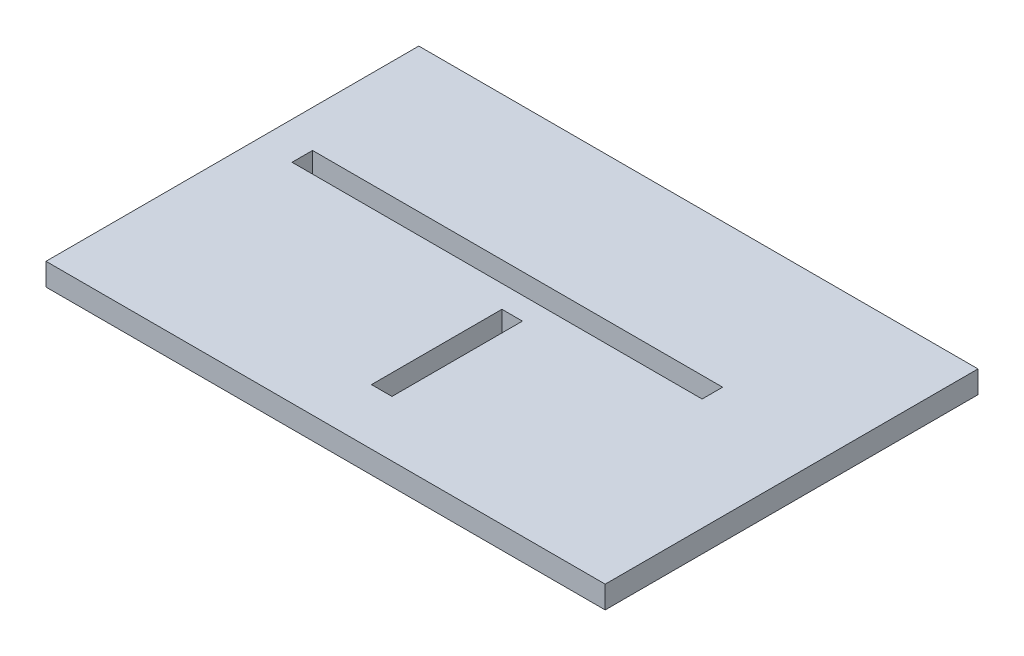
ISO-10303-21;
HEADER;
FILE_DESCRIPTION(('STEP AP214'),'2;1');
FILE_NAME('part.step','',(''),(''),'','','');
FILE_SCHEMA(('AUTOMOTIVE_DESIGN { 1 0 10303 214 1 1 1 1 }'));
ENDSEC;
DATA;
#1=APPLICATION_CONTEXT('core data for automotive mechanical design processes');
#2=APPLICATION_PROTOCOL_DEFINITION('international standard','automotive_design',2000,#1);
#3=PRODUCT_CONTEXT('',#1,'mechanical');
#4=PRODUCT('Part','Part','',(#3));
#5=PRODUCT_RELATED_PRODUCT_CATEGORY('part','',(#4));
#6=PRODUCT_DEFINITION_FORMATION('','',#4);
#7=PRODUCT_DEFINITION_CONTEXT('part definition',#1,'design');
#8=PRODUCT_DEFINITION('design','',#6,#7);
#9=PRODUCT_DEFINITION_SHAPE('','',#8);
#10=(LENGTH_UNIT() NAMED_UNIT(*) SI_UNIT(.MILLI.,.METRE.));
#11=(NAMED_UNIT(*) PLANE_ANGLE_UNIT() SI_UNIT($,.RADIAN.));
#12=(NAMED_UNIT(*) SI_UNIT($,.STERADIAN.) SOLID_ANGLE_UNIT());
#13=UNCERTAINTY_MEASURE_WITH_UNIT(LENGTH_MEASURE(1.E-05),#10,'distance_accuracy_value','');
#14=(GEOMETRIC_REPRESENTATION_CONTEXT(3) GLOBAL_UNCERTAINTY_ASSIGNED_CONTEXT((#13)) GLOBAL_UNIT_ASSIGNED_CONTEXT((#10,
#11,#12)) REPRESENTATION_CONTEXT('',''));
#15=CARTESIAN_POINT('',(0.,0.,0.));
#16=DIRECTION('',(0.,0.,1.));
#17=DIRECTION('',(1.,0.,0.));
#18=AXIS2_PLACEMENT_3D('',#15,#16,#17);
#19=CARTESIAN_POINT('',(0.,6.,0.));
#20=DIRECTION('',(0.,1.,0.));
#21=DIRECTION('',(0.,0.,1.));
#22=AXIS2_PLACEMENT_3D('',#19,#20,#21);
#23=PLANE('',#22);
#24=DIRECTION('',(0.,0.,-1.));
#25=VECTOR('',#24,1.);
#26=CARTESIAN_POINT('',(75.,6.,-50.));
#27=LINE('',#26,#25);
#28=CARTESIAN_POINT('',(75.,6.,50.));
#29=VERTEX_POINT('',#28);
#30=CARTESIAN_POINT('',(75.,6.,-50.));
#31=VERTEX_POINT('',#30);
#32=EDGE_CURVE('E193',#29,#31,#27,.T.);
#33=ORIENTED_EDGE('',*,*,#32,.T.);
#34=DIRECTION('',(-1.,0.,0.));
#35=VECTOR('',#34,1.);
#36=CARTESIAN_POINT('',(-75.,6.,-50.));
#37=LINE('',#36,#35);
#38=CARTESIAN_POINT('',(-75.,6.,-50.));
#39=VERTEX_POINT('',#38);
#40=EDGE_CURVE('E196',#31,#39,#37,.T.);
#41=ORIENTED_EDGE('',*,*,#40,.T.);
#42=DIRECTION('',(0.,0.,1.));
#43=VECTOR('',#42,1.);
#44=CARTESIAN_POINT('',(-75.,6.,-50.));
#45=LINE('',#44,#43);
#46=CARTESIAN_POINT('',(-75.,6.,50.));
#47=VERTEX_POINT('',#46);
#48=EDGE_CURVE('E199',#39,#47,#45,.T.);
#49=ORIENTED_EDGE('',*,*,#48,.T.);
#50=DIRECTION('',(1.,0.,0.));
#51=VECTOR('',#50,1.);
#52=CARTESIAN_POINT('',(-75.,6.,50.));
#53=LINE('',#52,#51);
#54=EDGE_CURVE('E201',#47,#29,#53,.T.);
#55=ORIENTED_EDGE('',*,*,#54,.T.);
#56=EDGE_LOOP('',(#33,#41,#49,#55));
#57=FACE_BOUND('',#56,.T.);
#58=DIRECTION('',(-1.,0.,0.));
#59=VECTOR('',#58,1.);
#60=CARTESIAN_POINT('',(-2.7,6.,0.));
#61=LINE('',#60,#59);
#62=CARTESIAN_POINT('',(2.79999999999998,6.,0.));
#63=VERTEX_POINT('',#62);
#64=CARTESIAN_POINT('',(-2.7,6.,0.));
#65=VERTEX_POINT('',#64);
#66=EDGE_CURVE('E164',#63,#65,#61,.T.);
#67=ORIENTED_EDGE('',*,*,#66,.F.);
#68=DIRECTION('',(0.,0.,-1.));
#69=VECTOR('',#68,1.);
#70=CARTESIAN_POINT('',(2.79999999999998,6.,0.));
#71=LINE('',#70,#69);
#72=CARTESIAN_POINT('',(2.8,6.,35.));
#73=VERTEX_POINT('',#72);
#74=EDGE_CURVE('E162',#73,#63,#71,.T.);
#75=ORIENTED_EDGE('',*,*,#74,.F.);
#76=DIRECTION('',(1.,0.,0.));
#77=VECTOR('',#76,1.);
#78=CARTESIAN_POINT('',(-2.7,6.,35.));
#79=LINE('',#78,#77);
#80=CARTESIAN_POINT('',(-2.7,6.,35.));
#81=VERTEX_POINT('',#80);
#82=EDGE_CURVE('E170',#81,#73,#79,.T.);
#83=ORIENTED_EDGE('',*,*,#82,.F.);
#84=DIRECTION('',(0.,0.,1.));
#85=VECTOR('',#84,1.);
#86=CARTESIAN_POINT('',(-2.7,6.,0.));
#87=LINE('',#86,#85);
#88=EDGE_CURVE('E167',#65,#81,#87,.T.);
#89=ORIENTED_EDGE('',*,*,#88,.F.);
#90=EDGE_LOOP('',(#67,#75,#83,#89));
#91=FACE_BOUND('',#90,.T.);
#92=DIRECTION('',(-1.,0.,0.));
#93=VECTOR('',#92,1.);
#94=CARTESIAN_POINT('',(-65.,6.,-11.5));
#95=LINE('',#94,#93);
#96=CARTESIAN_POINT('',(45.,6.,-11.5));
#97=VERTEX_POINT('',#96);
#98=CARTESIAN_POINT('',(-65.,6.,-11.5));
#99=VERTEX_POINT('',#98);
#100=EDGE_CURVE('E134',#97,#99,#95,.T.);
#101=ORIENTED_EDGE('',*,*,#100,.F.);
#102=DIRECTION('',(0.,0.,-1.));
#103=VECTOR('',#102,1.);
#104=CARTESIAN_POINT('',(45.,6.,-11.5));
#105=LINE('',#104,#103);
#106=CARTESIAN_POINT('',(45.,6.,-6.));
#107=VERTEX_POINT('',#106);
#108=EDGE_CURVE('E126',#107,#97,#105,.T.);
#109=ORIENTED_EDGE('',*,*,#108,.F.);
#110=DIRECTION('',(1.,0.,0.));
#111=VECTOR('',#110,1.);
#112=CARTESIAN_POINT('',(-65.,6.,-5.99999999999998));
#113=LINE('',#112,#111);
#114=CARTESIAN_POINT('',(-65.,6.,-5.99999999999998));
#115=VERTEX_POINT('',#114);
#116=EDGE_CURVE('E148',#115,#107,#113,.T.);
#117=ORIENTED_EDGE('',*,*,#116,.F.);
#118=DIRECTION('',(0.,0.,1.));
#119=VECTOR('',#118,1.);
#120=CARTESIAN_POINT('',(-65.,6.,-11.5));
#121=LINE('',#120,#119);
#122=EDGE_CURVE('E146',#99,#115,#121,.T.);
#123=ORIENTED_EDGE('',*,*,#122,.F.);
#124=EDGE_LOOP('',(#101,#109,#117,#123));
#125=FACE_BOUND('',#124,.T.);
#126=ADVANCED_FACE('F37',(#57,#91,#125),#23,.T.);
#127=CARTESIAN_POINT('',(0.,0.,0.));
#128=DIRECTION('',(0.,1.,0.));
#129=DIRECTION('',(0.,0.,1.));
#130=AXIS2_PLACEMENT_3D('',#127,#128,#129);
#131=PLANE('',#130);
#132=DIRECTION('',(0.,0.,-1.));
#133=VECTOR('',#132,1.);
#134=CARTESIAN_POINT('',(2.79999999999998,0.,0.));
#135=LINE('',#134,#133);
#136=CARTESIAN_POINT('',(2.8,0.,35.));
#137=VERTEX_POINT('',#136);
#138=CARTESIAN_POINT('',(2.79999999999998,0.,0.));
#139=VERTEX_POINT('',#138);
#140=EDGE_CURVE('E142',#137,#139,#135,.T.);
#141=ORIENTED_EDGE('',*,*,#140,.T.);
#142=DIRECTION('',(-1.,0.,0.));
#143=VECTOR('',#142,1.);
#144=CARTESIAN_POINT('',(-2.7,0.,0.));
#145=LINE('',#144,#143);
#146=CARTESIAN_POINT('',(-2.7,0.,0.));
#147=VERTEX_POINT('',#146);
#148=EDGE_CURVE('E175',#139,#147,#145,.T.);
#149=ORIENTED_EDGE('',*,*,#148,.T.);
#150=DIRECTION('',(0.,0.,1.));
#151=VECTOR('',#150,1.);
#152=CARTESIAN_POINT('',(-2.7,0.,0.));
#153=LINE('',#152,#151);
#154=CARTESIAN_POINT('',(-2.7,0.,35.));
#155=VERTEX_POINT('',#154);
#156=EDGE_CURVE('E178',#147,#155,#153,.T.);
#157=ORIENTED_EDGE('',*,*,#156,.T.);
#158=DIRECTION('',(1.,0.,0.));
#159=VECTOR('',#158,1.);
#160=CARTESIAN_POINT('',(-2.7,0.,35.));
#161=LINE('',#160,#159);
#162=EDGE_CURVE('E165',#155,#137,#161,.T.);
#163=ORIENTED_EDGE('',*,*,#162,.T.);
#164=EDGE_LOOP('',(#141,#149,#157,#163));
#165=FACE_BOUND('',#164,.T.);
#166=DIRECTION('',(0.,0.,-1.));
#167=VECTOR('',#166,1.);
#168=CARTESIAN_POINT('',(75.,0.,-50.));
#169=LINE('',#168,#167);
#170=CARTESIAN_POINT('',(75.,0.,50.));
#171=VERTEX_POINT('',#170);
#172=CARTESIAN_POINT('',(75.,0.,-50.));
#173=VERTEX_POINT('',#172);
#174=EDGE_CURVE('E192',#171,#173,#169,.T.);
#175=ORIENTED_EDGE('',*,*,#174,.F.);
#176=DIRECTION('',(1.,0.,0.));
#177=VECTOR('',#176,1.);
#178=CARTESIAN_POINT('',(-75.,0.,50.));
#179=LINE('',#178,#177);
#180=CARTESIAN_POINT('',(-75.,0.,50.));
#181=VERTEX_POINT('',#180);
#182=EDGE_CURVE('E197',#181,#171,#179,.T.);
#183=ORIENTED_EDGE('',*,*,#182,.F.);
#184=DIRECTION('',(0.,0.,1.));
#185=VECTOR('',#184,1.);
#186=CARTESIAN_POINT('',(-75.,0.,-50.));
#187=LINE('',#186,#185);
#188=CARTESIAN_POINT('',(-75.,0.,-50.));
#189=VERTEX_POINT('',#188);
#190=EDGE_CURVE('E208',#189,#181,#187,.T.);
#191=ORIENTED_EDGE('',*,*,#190,.F.);
#192=DIRECTION('',(-1.,0.,0.));
#193=VECTOR('',#192,1.);
#194=CARTESIAN_POINT('',(-75.,0.,-50.));
#195=LINE('',#194,#193);
#196=EDGE_CURVE('E206',#173,#189,#195,.T.);
#197=ORIENTED_EDGE('',*,*,#196,.F.);
#198=EDGE_LOOP('',(#175,#183,#191,#197));
#199=FACE_BOUND('',#198,.T.);
#200=DIRECTION('',(0.,0.,-1.));
#201=VECTOR('',#200,1.);
#202=CARTESIAN_POINT('',(45.,0.,-11.5));
#203=LINE('',#202,#201);
#204=CARTESIAN_POINT('',(45.,0.,-6.));
#205=VERTEX_POINT('',#204);
#206=CARTESIAN_POINT('',(45.,0.,-11.5));
#207=VERTEX_POINT('',#206);
#208=EDGE_CURVE('E60',#205,#207,#203,.T.);
#209=ORIENTED_EDGE('',*,*,#208,.T.);
#210=DIRECTION('',(-1.,0.,0.));
#211=VECTOR('',#210,1.);
#212=CARTESIAN_POINT('',(-65.,0.,-11.5));
#213=LINE('',#212,#211);
#214=CARTESIAN_POINT('',(-65.,0.,-11.5));
#215=VERTEX_POINT('',#214);
#216=EDGE_CURVE('E141',#207,#215,#213,.T.);
#217=ORIENTED_EDGE('',*,*,#216,.T.);
#218=DIRECTION('',(0.,0.,1.));
#219=VECTOR('',#218,1.);
#220=CARTESIAN_POINT('',(-65.,0.,-11.5));
#221=LINE('',#220,#219);
#222=CARTESIAN_POINT('',(-65.,0.,-5.99999999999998));
#223=VERTEX_POINT('',#222);
#224=EDGE_CURVE('E154',#215,#223,#221,.T.);
#225=ORIENTED_EDGE('',*,*,#224,.T.);
#226=DIRECTION('',(1.,0.,0.));
#227=VECTOR('',#226,1.);
#228=CARTESIAN_POINT('',(-65.,0.,-5.99999999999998));
#229=LINE('',#228,#227);
#230=EDGE_CURVE('E135',#223,#205,#229,.T.);
#231=ORIENTED_EDGE('',*,*,#230,.T.);
#232=EDGE_LOOP('',(#209,#217,#225,#231));
#233=FACE_BOUND('',#232,.T.);
#234=ADVANCED_FACE('F226',(#165,#199,#233),#131,.F.);
#235=CARTESIAN_POINT('',(75.,6.,-50.));
#236=DIRECTION('',(-1.,0.,0.));
#237=DIRECTION('',(0.,0.,1.));
#238=AXIS2_PLACEMENT_3D('',#235,#236,#237);
#239=PLANE('',#238);
#240=ORIENTED_EDGE('',*,*,#174,.T.);
#241=DIRECTION('',(0.,-1.,0.));
#242=VECTOR('',#241,1.);
#243=CARTESIAN_POINT('',(75.,6.,-50.));
#244=LINE('',#243,#242);
#245=EDGE_CURVE('E11',#31,#173,#244,.T.);
#246=ORIENTED_EDGE('',*,*,#245,.F.);
#247=ORIENTED_EDGE('',*,*,#32,.F.);
#248=DIRECTION('',(0.,-1.,0.));
#249=VECTOR('',#248,1.);
#250=CARTESIAN_POINT('',(75.,6.,50.));
#251=LINE('',#250,#249);
#252=EDGE_CURVE('E203',#29,#171,#251,.T.);
#253=ORIENTED_EDGE('',*,*,#252,.T.);
#254=EDGE_LOOP('',(#240,#246,#247,#253));
#255=FACE_BOUND('',#254,.T.);
#256=ADVANCED_FACE('F39',(#255),#239,.F.);
#257=CARTESIAN_POINT('',(-75.,6.,-50.));
#258=DIRECTION('',(0.,0.,1.));
#259=DIRECTION('',(1.,0.,0.));
#260=AXIS2_PLACEMENT_3D('',#257,#258,#259);
#261=PLANE('',#260);
#262=ORIENTED_EDGE('',*,*,#196,.T.);
#263=DIRECTION('',(0.,-1.,0.));
#264=VECTOR('',#263,1.);
#265=CARTESIAN_POINT('',(-75.,6.,-50.));
#266=LINE('',#265,#264);
#267=EDGE_CURVE('E45',#39,#189,#266,.T.);
#268=ORIENTED_EDGE('',*,*,#267,.F.);
#269=ORIENTED_EDGE('',*,*,#40,.F.);
#270=ORIENTED_EDGE('',*,*,#245,.T.);
#271=EDGE_LOOP('',(#262,#268,#269,#270));
#272=FACE_BOUND('',#271,.T.);
#273=ADVANCED_FACE('F237',(#272),#261,.F.);
#274=CARTESIAN_POINT('',(-75.,6.,-50.));
#275=DIRECTION('',(1.,0.,0.));
#276=DIRECTION('',(0.,0.,-1.));
#277=AXIS2_PLACEMENT_3D('',#274,#275,#276);
#278=PLANE('',#277);
#279=ORIENTED_EDGE('',*,*,#190,.T.);
#280=DIRECTION('',(0.,-1.,0.));
#281=VECTOR('',#280,1.);
#282=CARTESIAN_POINT('',(-75.,6.,50.));
#283=LINE('',#282,#281);
#284=EDGE_CURVE('E213',#47,#181,#283,.T.);
#285=ORIENTED_EDGE('',*,*,#284,.F.);
#286=ORIENTED_EDGE('',*,*,#48,.F.);
#287=ORIENTED_EDGE('',*,*,#267,.T.);
#288=EDGE_LOOP('',(#279,#285,#286,#287));
#289=FACE_BOUND('',#288,.T.);
#290=ADVANCED_FACE('F220',(#289),#278,.F.);
#291=CARTESIAN_POINT('',(-75.,6.,50.));
#292=DIRECTION('',(0.,0.,-1.));
#293=DIRECTION('',(-1.,0.,0.));
#294=AXIS2_PLACEMENT_3D('',#291,#292,#293);
#295=PLANE('',#294);
#296=ORIENTED_EDGE('',*,*,#182,.T.);
#297=ORIENTED_EDGE('',*,*,#252,.F.);
#298=ORIENTED_EDGE('',*,*,#54,.F.);
#299=ORIENTED_EDGE('',*,*,#284,.T.);
#300=EDGE_LOOP('',(#296,#297,#298,#299));
#301=FACE_BOUND('',#300,.T.);
#302=ADVANCED_FACE('F230',(#301),#295,.F.);
#303=CARTESIAN_POINT('',(2.79999999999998,6.,0.));
#304=DIRECTION('',(-1.,0.,0.));
#305=DIRECTION('',(0.,0.,1.));
#306=AXIS2_PLACEMENT_3D('',#303,#304,#305);
#307=PLANE('',#306);
#308=ORIENTED_EDGE('',*,*,#140,.F.);
#309=DIRECTION('',(0.,-1.,0.));
#310=VECTOR('',#309,1.);
#311=CARTESIAN_POINT('',(2.8,6.,35.));
#312=LINE('',#311,#310);
#313=EDGE_CURVE('E172',#73,#137,#312,.T.);
#314=ORIENTED_EDGE('',*,*,#313,.F.);
#315=ORIENTED_EDGE('',*,*,#74,.T.);
#316=DIRECTION('',(0.,-1.,0.));
#317=VECTOR('',#316,1.);
#318=CARTESIAN_POINT('',(2.79999999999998,6.,0.));
#319=LINE('',#318,#317);
#320=EDGE_CURVE('E189',#63,#139,#319,.T.);
#321=ORIENTED_EDGE('',*,*,#320,.T.);
#322=EDGE_LOOP('',(#308,#314,#315,#321));
#323=FACE_BOUND('',#322,.T.);
#324=ADVANCED_FACE('F252',(#323),#307,.T.);
#325=CARTESIAN_POINT('',(-2.7,6.,0.));
#326=DIRECTION('',(0.,0.,1.));
#327=DIRECTION('',(1.,0.,0.));
#328=AXIS2_PLACEMENT_3D('',#325,#326,#327);
#329=PLANE('',#328);
#330=ORIENTED_EDGE('',*,*,#148,.F.);
#331=ORIENTED_EDGE('',*,*,#320,.F.);
#332=ORIENTED_EDGE('',*,*,#66,.T.);
#333=DIRECTION('',(0.,-1.,0.));
#334=VECTOR('',#333,1.);
#335=CARTESIAN_POINT('',(-2.7,6.,0.));
#336=LINE('',#335,#334);
#337=EDGE_CURVE('E187',#65,#147,#336,.T.);
#338=ORIENTED_EDGE('',*,*,#337,.T.);
#339=EDGE_LOOP('',(#330,#331,#332,#338));
#340=FACE_BOUND('',#339,.T.);
#341=ADVANCED_FACE('F259',(#340),#329,.T.);
#342=CARTESIAN_POINT('',(-2.7,6.,0.));
#343=DIRECTION('',(1.,0.,0.));
#344=DIRECTION('',(0.,0.,-1.));
#345=AXIS2_PLACEMENT_3D('',#342,#343,#344);
#346=PLANE('',#345);
#347=ORIENTED_EDGE('',*,*,#156,.F.);
#348=ORIENTED_EDGE('',*,*,#337,.F.);
#349=ORIENTED_EDGE('',*,*,#88,.T.);
#350=DIRECTION('',(0.,-1.,0.));
#351=VECTOR('',#350,1.);
#352=CARTESIAN_POINT('',(-2.7,6.,35.));
#353=LINE('',#352,#351);
#354=EDGE_CURVE('E185',#81,#155,#353,.T.);
#355=ORIENTED_EDGE('',*,*,#354,.T.);
#356=EDGE_LOOP('',(#347,#348,#349,#355));
#357=FACE_BOUND('',#356,.T.);
#358=ADVANCED_FACE('F264',(#357),#346,.T.);
#359=CARTESIAN_POINT('',(-2.7,6.,35.));
#360=DIRECTION('',(0.,0.,-1.));
#361=DIRECTION('',(-1.,0.,0.));
#362=AXIS2_PLACEMENT_3D('',#359,#360,#361);
#363=PLANE('',#362);
#364=ORIENTED_EDGE('',*,*,#162,.F.);
#365=ORIENTED_EDGE('',*,*,#354,.F.);
#366=ORIENTED_EDGE('',*,*,#82,.T.);
#367=ORIENTED_EDGE('',*,*,#313,.T.);
#368=EDGE_LOOP('',(#364,#365,#366,#367));
#369=FACE_BOUND('',#368,.T.);
#370=ADVANCED_FACE('F271',(#369),#363,.T.);
#371=CARTESIAN_POINT('',(45.,6.,-11.5));
#372=DIRECTION('',(-1.,0.,0.));
#373=DIRECTION('',(0.,0.,1.));
#374=AXIS2_PLACEMENT_3D('',#371,#372,#373);
#375=PLANE('',#374);
#376=ORIENTED_EDGE('',*,*,#208,.F.);
#377=DIRECTION('',(0.,-1.,0.));
#378=VECTOR('',#377,1.);
#379=CARTESIAN_POINT('',(45.,6.,-6.));
#380=LINE('',#379,#378);
#381=EDGE_CURVE('E130',#107,#205,#380,.T.);
#382=ORIENTED_EDGE('',*,*,#381,.F.);
#383=ORIENTED_EDGE('',*,*,#108,.T.);
#384=DIRECTION('',(0.,-1.,0.));
#385=VECTOR('',#384,1.);
#386=CARTESIAN_POINT('',(45.,6.,-11.5));
#387=LINE('',#386,#385);
#388=EDGE_CURVE('E129',#97,#207,#387,.T.);
#389=ORIENTED_EDGE('',*,*,#388,.T.);
#390=EDGE_LOOP('',(#376,#382,#383,#389));
#391=FACE_BOUND('',#390,.T.);
#392=ADVANCED_FACE('F128',(#391),#375,.T.);
#393=CARTESIAN_POINT('',(-65.,6.,-11.5));
#394=DIRECTION('',(0.,0.,1.));
#395=DIRECTION('',(1.,0.,0.));
#396=AXIS2_PLACEMENT_3D('',#393,#394,#395);
#397=PLANE('',#396);
#398=ORIENTED_EDGE('',*,*,#216,.F.);
#399=ORIENTED_EDGE('',*,*,#388,.F.);
#400=ORIENTED_EDGE('',*,*,#100,.T.);
#401=DIRECTION('',(0.,-1.,0.));
#402=VECTOR('',#401,1.);
#403=CARTESIAN_POINT('',(-65.,6.,-11.5));
#404=LINE('',#403,#402);
#405=EDGE_CURVE('E143',#99,#215,#404,.T.);
#406=ORIENTED_EDGE('',*,*,#405,.T.);
#407=EDGE_LOOP('',(#398,#399,#400,#406));
#408=FACE_BOUND('',#407,.T.);
#409=ADVANCED_FACE('F138',(#408),#397,.T.);
#410=CARTESIAN_POINT('',(-65.,6.,-11.5));
#411=DIRECTION('',(1.,0.,0.));
#412=DIRECTION('',(0.,0.,-1.));
#413=AXIS2_PLACEMENT_3D('',#410,#411,#412);
#414=PLANE('',#413);
#415=ORIENTED_EDGE('',*,*,#224,.F.);
#416=ORIENTED_EDGE('',*,*,#405,.F.);
#417=ORIENTED_EDGE('',*,*,#122,.T.);
#418=DIRECTION('',(0.,-1.,0.));
#419=VECTOR('',#418,1.);
#420=CARTESIAN_POINT('',(-65.,6.,-5.99999999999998));
#421=LINE('',#420,#419);
#422=EDGE_CURVE('E52',#115,#223,#421,.T.);
#423=ORIENTED_EDGE('',*,*,#422,.T.);
#424=EDGE_LOOP('',(#415,#416,#417,#423));
#425=FACE_BOUND('',#424,.T.);
#426=ADVANCED_FACE('F289',(#425),#414,.T.);
#427=CARTESIAN_POINT('',(-65.,6.,-5.99999999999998));
#428=DIRECTION('',(0.,0.,-1.));
#429=DIRECTION('',(-1.,0.,0.));
#430=AXIS2_PLACEMENT_3D('',#427,#428,#429);
#431=PLANE('',#430);
#432=ORIENTED_EDGE('',*,*,#230,.F.);
#433=ORIENTED_EDGE('',*,*,#422,.F.);
#434=ORIENTED_EDGE('',*,*,#116,.T.);
#435=ORIENTED_EDGE('',*,*,#381,.T.);
#436=EDGE_LOOP('',(#432,#433,#434,#435));
#437=FACE_BOUND('',#436,.T.);
#438=ADVANCED_FACE('F292',(#437),#431,.T.);
#439=CLOSED_SHELL('',(#126,#234,#256,#273,#290,#302,#324,#341,#358,#370,#392,#409,#426,#438));
#440=MANIFOLD_SOLID_BREP('B2',#439);
#441=ADVANCED_BREP_SHAPE_REPRESENTATION('',(#18,#440),#14);
#442=SHAPE_DEFINITION_REPRESENTATION(#9,#441);
ENDSEC;
END-ISO-10303-21;
